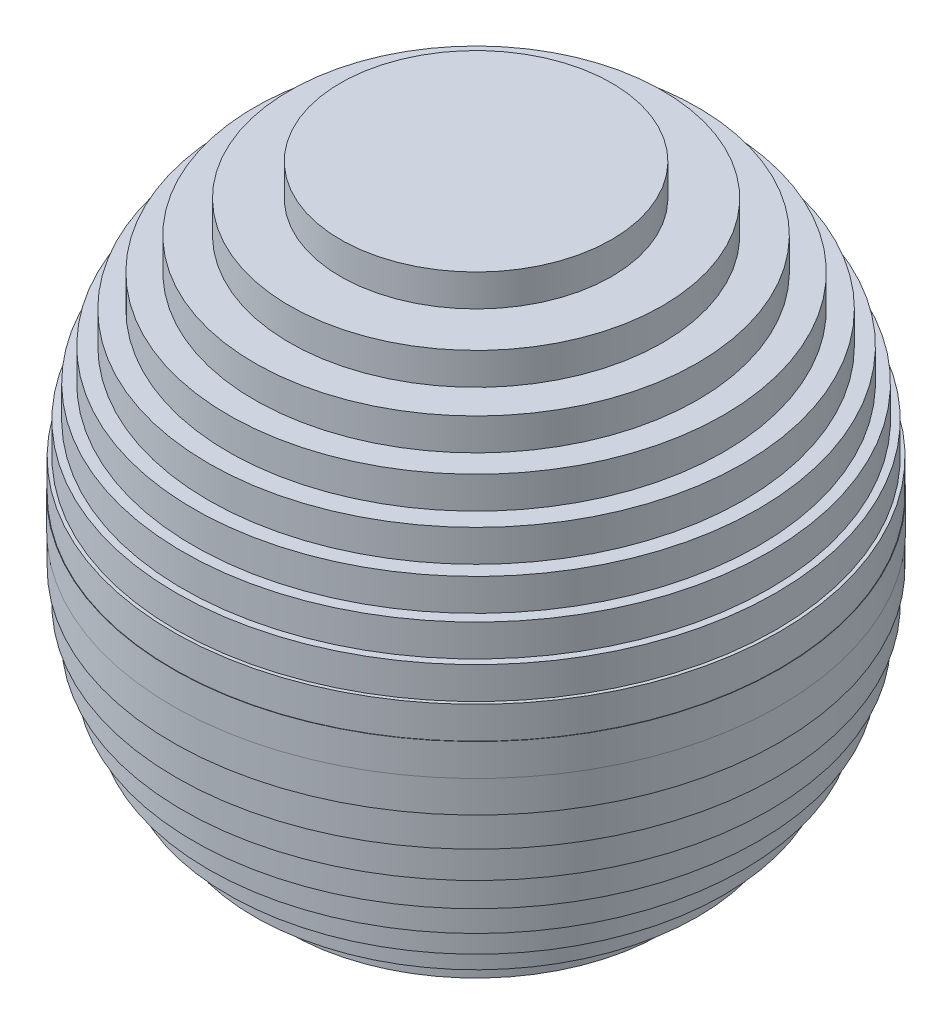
ISO-10303-21;
HEADER;
FILE_DESCRIPTION(('STEP AP214'),'2;1');
FILE_NAME('part.step','',(''),(''),'','','');
FILE_SCHEMA(('AUTOMOTIVE_DESIGN { 1 0 10303 214 1 1 1 1 }'));
ENDSEC;
DATA;
#1=APPLICATION_CONTEXT('core data for automotive mechanical design processes');
#2=APPLICATION_PROTOCOL_DEFINITION('international standard','automotive_design',2000,#1);
#3=PRODUCT_CONTEXT('',#1,'mechanical');
#4=PRODUCT('Part','Part','',(#3));
#5=PRODUCT_RELATED_PRODUCT_CATEGORY('part','',(#4));
#6=PRODUCT_DEFINITION_FORMATION('','',#4);
#7=PRODUCT_DEFINITION_CONTEXT('part definition',#1,'design');
#8=PRODUCT_DEFINITION('design','',#6,#7);
#9=PRODUCT_DEFINITION_SHAPE('','',#8);
#10=(LENGTH_UNIT() NAMED_UNIT(*) SI_UNIT(.MILLI.,.METRE.));
#11=(NAMED_UNIT(*) PLANE_ANGLE_UNIT() SI_UNIT($,.RADIAN.));
#12=(NAMED_UNIT(*) SI_UNIT($,.STERADIAN.) SOLID_ANGLE_UNIT());
#13=UNCERTAINTY_MEASURE_WITH_UNIT(LENGTH_MEASURE(1.E-05),#10,'distance_accuracy_value','');
#14=(GEOMETRIC_REPRESENTATION_CONTEXT(3) GLOBAL_UNCERTAINTY_ASSIGNED_CONTEXT((#13)) GLOBAL_UNIT_ASSIGNED_CONTEXT((#10,
#11,#12)) REPRESENTATION_CONTEXT('',''));
#15=CARTESIAN_POINT('',(0.,0.,0.));
#16=DIRECTION('',(0.,0.,1.));
#17=DIRECTION('',(1.,0.,0.));
#18=AXIS2_PLACEMENT_3D('',#15,#16,#17);
#19=CARTESIAN_POINT('',(47.4341649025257,2.49999999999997,0.));
#20=DIRECTION('',(0.,1.,0.));
#21=DIRECTION('',(-1.,0.,0.));
#22=AXIS2_PLACEMENT_3D('',#19,#20,#21);
#23=PLANE('',#22);
#24=CARTESIAN_POINT('',(0.,2.49999999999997,0.));
#25=DIRECTION('',(0.,-1.,0.));
#26=DIRECTION('',(1.,0.,0.));
#27=AXIS2_PLACEMENT_3D('',#24,#25,#26);
#28=CIRCLE('',#27,47.4341649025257);
#29=CARTESIAN_POINT('',(47.4341649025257,2.49999999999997,0.));
#30=VERTEX_POINT('',#29);
#31=EDGE_CURVE('E150',#30,#30,#28,.T.);
#32=ORIENTED_EDGE('',*,*,#31,.T.);
#33=EDGE_LOOP('',(#32));
#34=FACE_BOUND('',#33,.T.);
#35=CARTESIAN_POINT('',(0.,2.49999999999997,0.));
#36=DIRECTION('',(0.,-1.,0.));
#37=DIRECTION('',(1.,0.,0.));
#38=AXIS2_PLACEMENT_3D('',#35,#36,#37);
#39=CIRCLE('',#38,47.4999999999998);
#40=CARTESIAN_POINT('',(47.4999999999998,2.49999999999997,0.));
#41=VERTEX_POINT('',#40);
#42=EDGE_CURVE('E10',#41,#41,#39,.T.);
#43=ORIENTED_EDGE('',*,*,#42,.F.);
#44=EDGE_LOOP('',(#43));
#45=FACE_BOUND('',#44,.T.);
#46=ADVANCED_FACE('F32',(#34,#45),#23,.T.);
#47=CARTESIAN_POINT('',(0.,-47.5,0.));
#48=DIRECTION('',(0.,-1.,0.));
#49=DIRECTION('',(1.,0.,0.));
#50=AXIS2_PLACEMENT_3D('',#47,#48,#49);
#51=CYLINDRICAL_SURFACE('',#50,47.4999999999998);
#52=ORIENTED_EDGE('',*,*,#42,.T.);
#53=EDGE_LOOP('',(#52));
#54=FACE_BOUND('',#53,.T.);
#55=CARTESIAN_POINT('',(0.,-2.50000000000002,0.));
#56=DIRECTION('',(0.,-1.,0.));
#57=DIRECTION('',(1.,0.,0.));
#58=AXIS2_PLACEMENT_3D('',#55,#56,#57);
#59=CIRCLE('',#58,47.4999999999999);
#60=CARTESIAN_POINT('',(47.4999999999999,-2.50000000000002,0.));
#61=VERTEX_POINT('',#60);
#62=EDGE_CURVE('E38',#61,#61,#59,.T.);
#63=ORIENTED_EDGE('',*,*,#62,.F.);
#64=EDGE_LOOP('',(#63));
#65=FACE_BOUND('',#64,.T.);
#66=ADVANCED_FACE('F168',(#54,#65),#51,.T.);
#67=CARTESIAN_POINT('',(47.4999999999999,-2.50000000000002,0.));
#68=DIRECTION('',(0.,-1.,0.));
#69=DIRECTION('',(1.,0.,0.));
#70=AXIS2_PLACEMENT_3D('',#67,#68,#69);
#71=PLANE('',#70);
#72=ORIENTED_EDGE('',*,*,#62,.T.);
#73=EDGE_LOOP('',(#72));
#74=FACE_BOUND('',#73,.T.);
#75=CARTESIAN_POINT('',(0.,-2.50000000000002,0.));
#76=DIRECTION('',(0.,-1.,0.));
#77=DIRECTION('',(1.,0.,0.));
#78=AXIS2_PLACEMENT_3D('',#75,#76,#77);
#79=CIRCLE('',#78,47.4341649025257);
#80=CARTESIAN_POINT('',(47.4341649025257,-2.50000000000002,0.));
#81=VERTEX_POINT('',#80);
#82=EDGE_CURVE('E42',#81,#81,#79,.T.);
#83=ORIENTED_EDGE('',*,*,#82,.F.);
#84=EDGE_LOOP('',(#83));
#85=FACE_BOUND('',#84,.T.);
#86=ADVANCED_FACE('F172',(#74,#85),#71,.T.);
#87=CARTESIAN_POINT('',(0.,-47.5,0.));
#88=DIRECTION('',(0.,-1.,0.));
#89=DIRECTION('',(1.,0.,0.));
#90=AXIS2_PLACEMENT_3D('',#87,#88,#89);
#91=CYLINDRICAL_SURFACE('',#90,47.4341649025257);
#92=ORIENTED_EDGE('',*,*,#82,.T.);
#93=EDGE_LOOP('',(#92));
#94=FACE_BOUND('',#93,.T.);
#95=CARTESIAN_POINT('',(0.,-7.50000000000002,0.));
#96=DIRECTION('',(0.,-1.,0.));
#97=DIRECTION('',(1.,0.,0.));
#98=AXIS2_PLACEMENT_3D('',#95,#96,#97);
#99=CIRCLE('',#98,47.4341649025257);
#100=CARTESIAN_POINT('',(47.4341649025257,-7.50000000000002,0.));
#101=VERTEX_POINT('',#100);
#102=EDGE_CURVE('E46',#101,#101,#99,.T.);
#103=ORIENTED_EDGE('',*,*,#102,.F.);
#104=EDGE_LOOP('',(#103));
#105=FACE_BOUND('',#104,.T.);
#106=ADVANCED_FACE('F176',(#94,#105),#91,.T.);
#107=CARTESIAN_POINT('',(47.4341649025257,-7.50000000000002,0.));
#108=DIRECTION('',(0.,-1.,0.));
#109=DIRECTION('',(1.,0.,0.));
#110=AXIS2_PLACEMENT_3D('',#107,#108,#109);
#111=PLANE('',#110);
#112=ORIENTED_EDGE('',*,*,#102,.T.);
#113=EDGE_LOOP('',(#112));
#114=FACE_BOUND('',#113,.T.);
#115=CARTESIAN_POINT('',(0.,-7.50000000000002,0.));
#116=DIRECTION('',(0.,-1.,0.));
#117=DIRECTION('',(1.,0.,0.));
#118=AXIS2_PLACEMENT_3D('',#115,#116,#117);
#119=CIRCLE('',#118,46.9041575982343);
#120=CARTESIAN_POINT('',(46.9041575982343,-7.50000000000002,0.));
#121=VERTEX_POINT('',#120);
#122=EDGE_CURVE('E51',#121,#121,#119,.T.);
#123=ORIENTED_EDGE('',*,*,#122,.F.);
#124=EDGE_LOOP('',(#123));
#125=FACE_BOUND('',#124,.T.);
#126=ADVANCED_FACE('F182',(#114,#125),#111,.T.);
#127=CARTESIAN_POINT('',(0.,-47.5,0.));
#128=DIRECTION('',(0.,-1.,0.));
#129=DIRECTION('',(1.,0.,0.));
#130=AXIS2_PLACEMENT_3D('',#127,#128,#129);
#131=CYLINDRICAL_SURFACE('',#130,46.9041575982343);
#132=ORIENTED_EDGE('',*,*,#122,.T.);
#133=EDGE_LOOP('',(#132));
#134=FACE_BOUND('',#133,.T.);
#135=CARTESIAN_POINT('',(0.,-12.5,0.));
#136=DIRECTION('',(0.,-1.,0.));
#137=DIRECTION('',(1.,0.,0.));
#138=AXIS2_PLACEMENT_3D('',#135,#136,#137);
#139=CIRCLE('',#138,46.9041575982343);
#140=CARTESIAN_POINT('',(46.9041575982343,-12.5,0.));
#141=VERTEX_POINT('',#140);
#142=EDGE_CURVE('E54',#141,#141,#139,.T.);
#143=ORIENTED_EDGE('',*,*,#142,.F.);
#144=EDGE_LOOP('',(#143));
#145=FACE_BOUND('',#144,.T.);
#146=ADVANCED_FACE('F186',(#134,#145),#131,.T.);
#147=CARTESIAN_POINT('',(46.9041575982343,-12.5,0.));
#148=DIRECTION('',(0.,-1.,0.));
#149=DIRECTION('',(1.,0.,0.));
#150=AXIS2_PLACEMENT_3D('',#147,#148,#149);
#151=PLANE('',#150);
#152=ORIENTED_EDGE('',*,*,#142,.T.);
#153=EDGE_LOOP('',(#152));
#154=FACE_BOUND('',#153,.T.);
#155=CARTESIAN_POINT('',(0.,-12.5,0.));
#156=DIRECTION('',(0.,-1.,0.));
#157=DIRECTION('',(1.,0.,0.));
#158=AXIS2_PLACEMENT_3D('',#155,#156,#157);
#159=CIRCLE('',#158,45.8257569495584);
#160=CARTESIAN_POINT('',(45.8257569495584,-12.5,0.));
#161=VERTEX_POINT('',#160);
#162=EDGE_CURVE('E57',#161,#161,#159,.T.);
#163=ORIENTED_EDGE('',*,*,#162,.F.);
#164=EDGE_LOOP('',(#163));
#165=FACE_BOUND('',#164,.T.);
#166=ADVANCED_FACE('F190',(#154,#165),#151,.T.);
#167=CARTESIAN_POINT('',(0.,-47.5,0.));
#168=DIRECTION('',(0.,-1.,0.));
#169=DIRECTION('',(1.,0.,0.));
#170=AXIS2_PLACEMENT_3D('',#167,#168,#169);
#171=CYLINDRICAL_SURFACE('',#170,45.8257569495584);
#172=ORIENTED_EDGE('',*,*,#162,.T.);
#173=EDGE_LOOP('',(#172));
#174=FACE_BOUND('',#173,.T.);
#175=CARTESIAN_POINT('',(0.,-17.5,0.));
#176=DIRECTION('',(0.,-1.,0.));
#177=DIRECTION('',(1.,0.,0.));
#178=AXIS2_PLACEMENT_3D('',#175,#176,#177);
#179=CIRCLE('',#178,45.8257569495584);
#180=CARTESIAN_POINT('',(45.8257569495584,-17.5,0.));
#181=VERTEX_POINT('',#180);
#182=EDGE_CURVE('E60',#181,#181,#179,.T.);
#183=ORIENTED_EDGE('',*,*,#182,.F.);
#184=EDGE_LOOP('',(#183));
#185=FACE_BOUND('',#184,.T.);
#186=ADVANCED_FACE('F194',(#174,#185),#171,.T.);
#187=CARTESIAN_POINT('',(45.8257569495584,-17.5,0.));
#188=DIRECTION('',(0.,-1.,0.));
#189=DIRECTION('',(1.,0.,0.));
#190=AXIS2_PLACEMENT_3D('',#187,#188,#189);
#191=PLANE('',#190);
#192=ORIENTED_EDGE('',*,*,#182,.T.);
#193=EDGE_LOOP('',(#192));
#194=FACE_BOUND('',#193,.T.);
#195=CARTESIAN_POINT('',(0.,-17.5,0.));
#196=DIRECTION('',(0.,-1.,0.));
#197=DIRECTION('',(1.,0.,0.));
#198=AXIS2_PLACEMENT_3D('',#195,#196,#197);
#199=CIRCLE('',#198,44.1588043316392);
#200=CARTESIAN_POINT('',(44.1588043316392,-17.5,0.));
#201=VERTEX_POINT('',#200);
#202=EDGE_CURVE('E63',#201,#201,#199,.T.);
#203=ORIENTED_EDGE('',*,*,#202,.F.);
#204=EDGE_LOOP('',(#203));
#205=FACE_BOUND('',#204,.T.);
#206=ADVANCED_FACE('F198',(#194,#205),#191,.T.);
#207=CARTESIAN_POINT('',(0.,-47.5,0.));
#208=DIRECTION('',(0.,-1.,0.));
#209=DIRECTION('',(1.,0.,0.));
#210=AXIS2_PLACEMENT_3D('',#207,#208,#209);
#211=CYLINDRICAL_SURFACE('',#210,44.1588043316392);
#212=ORIENTED_EDGE('',*,*,#202,.T.);
#213=EDGE_LOOP('',(#212));
#214=FACE_BOUND('',#213,.T.);
#215=CARTESIAN_POINT('',(0.,-22.5,0.));
#216=DIRECTION('',(0.,-1.,0.));
#217=DIRECTION('',(1.,0.,0.));
#218=AXIS2_PLACEMENT_3D('',#215,#216,#217);
#219=CIRCLE('',#218,44.1588043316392);
#220=CARTESIAN_POINT('',(44.1588043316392,-22.5,0.));
#221=VERTEX_POINT('',#220);
#222=EDGE_CURVE('E66',#221,#221,#219,.T.);
#223=ORIENTED_EDGE('',*,*,#222,.F.);
#224=EDGE_LOOP('',(#223));
#225=FACE_BOUND('',#224,.T.);
#226=ADVANCED_FACE('F202',(#214,#225),#211,.T.);
#227=CARTESIAN_POINT('',(44.1588043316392,-22.5,0.));
#228=DIRECTION('',(0.,-1.,0.));
#229=DIRECTION('',(1.,0.,0.));
#230=AXIS2_PLACEMENT_3D('',#227,#228,#229);
#231=PLANE('',#230);
#232=ORIENTED_EDGE('',*,*,#222,.T.);
#233=EDGE_LOOP('',(#232));
#234=FACE_BOUND('',#233,.T.);
#235=CARTESIAN_POINT('',(0.,-22.5,0.));
#236=DIRECTION('',(0.,-1.,0.));
#237=DIRECTION('',(1.,0.,0.));
#238=AXIS2_PLACEMENT_3D('',#235,#236,#237);
#239=CIRCLE('',#238,41.8330013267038);
#240=CARTESIAN_POINT('',(41.8330013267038,-22.5,0.));
#241=VERTEX_POINT('',#240);
#242=EDGE_CURVE('E69',#241,#241,#239,.T.);
#243=ORIENTED_EDGE('',*,*,#242,.F.);
#244=EDGE_LOOP('',(#243));
#245=FACE_BOUND('',#244,.T.);
#246=ADVANCED_FACE('F206',(#234,#245),#231,.T.);
#247=CARTESIAN_POINT('',(0.,-47.5,0.));
#248=DIRECTION('',(0.,-1.,0.));
#249=DIRECTION('',(1.,0.,0.));
#250=AXIS2_PLACEMENT_3D('',#247,#248,#249);
#251=CYLINDRICAL_SURFACE('',#250,41.8330013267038);
#252=ORIENTED_EDGE('',*,*,#242,.T.);
#253=EDGE_LOOP('',(#252));
#254=FACE_BOUND('',#253,.T.);
#255=CARTESIAN_POINT('',(0.,-27.5,0.));
#256=DIRECTION('',(0.,-1.,0.));
#257=DIRECTION('',(1.,0.,0.));
#258=AXIS2_PLACEMENT_3D('',#255,#256,#257);
#259=CIRCLE('',#258,41.8330013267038);
#260=CARTESIAN_POINT('',(41.8330013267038,-27.5,0.));
#261=VERTEX_POINT('',#260);
#262=EDGE_CURVE('E72',#261,#261,#259,.T.);
#263=ORIENTED_EDGE('',*,*,#262,.F.);
#264=EDGE_LOOP('',(#263));
#265=FACE_BOUND('',#264,.T.);
#266=ADVANCED_FACE('F210',(#254,#265),#251,.T.);
#267=CARTESIAN_POINT('',(41.8330013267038,-27.5,0.));
#268=DIRECTION('',(0.,-1.,0.));
#269=DIRECTION('',(1.,0.,0.));
#270=AXIS2_PLACEMENT_3D('',#267,#268,#269);
#271=PLANE('',#270);
#272=ORIENTED_EDGE('',*,*,#262,.T.);
#273=EDGE_LOOP('',(#272));
#274=FACE_BOUND('',#273,.T.);
#275=CARTESIAN_POINT('',(0.,-27.5,0.));
#276=DIRECTION('',(0.,-1.,0.));
#277=DIRECTION('',(1.,0.,0.));
#278=AXIS2_PLACEMENT_3D('',#275,#276,#277);
#279=CIRCLE('',#278,38.7298334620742);
#280=CARTESIAN_POINT('',(38.7298334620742,-27.5,0.));
#281=VERTEX_POINT('',#280);
#282=EDGE_CURVE('E75',#281,#281,#279,.T.);
#283=ORIENTED_EDGE('',*,*,#282,.F.);
#284=EDGE_LOOP('',(#283));
#285=FACE_BOUND('',#284,.T.);
#286=ADVANCED_FACE('F214',(#274,#285),#271,.T.);
#287=CARTESIAN_POINT('',(0.,-47.5,0.));
#288=DIRECTION('',(0.,-1.,0.));
#289=DIRECTION('',(1.,0.,0.));
#290=AXIS2_PLACEMENT_3D('',#287,#288,#289);
#291=CYLINDRICAL_SURFACE('',#290,38.7298334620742);
#292=ORIENTED_EDGE('',*,*,#282,.T.);
#293=EDGE_LOOP('',(#292));
#294=FACE_BOUND('',#293,.T.);
#295=CARTESIAN_POINT('',(0.,-32.5,0.));
#296=DIRECTION('',(0.,-1.,0.));
#297=DIRECTION('',(1.,0.,0.));
#298=AXIS2_PLACEMENT_3D('',#295,#296,#297);
#299=CIRCLE('',#298,38.7298334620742);
#300=CARTESIAN_POINT('',(38.7298334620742,-32.5,0.));
#301=VERTEX_POINT('',#300);
#302=EDGE_CURVE('E78',#301,#301,#299,.T.);
#303=ORIENTED_EDGE('',*,*,#302,.F.);
#304=EDGE_LOOP('',(#303));
#305=FACE_BOUND('',#304,.T.);
#306=ADVANCED_FACE('F218',(#294,#305),#291,.T.);
#307=CARTESIAN_POINT('',(38.7298334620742,-32.5,0.));
#308=DIRECTION('',(0.,-1.,0.));
#309=DIRECTION('',(1.,0.,0.));
#310=AXIS2_PLACEMENT_3D('',#307,#308,#309);
#311=PLANE('',#310);
#312=ORIENTED_EDGE('',*,*,#302,.T.);
#313=EDGE_LOOP('',(#312));
#314=FACE_BOUND('',#313,.T.);
#315=CARTESIAN_POINT('',(0.,-32.5,0.));
#316=DIRECTION('',(0.,-1.,0.));
#317=DIRECTION('',(1.,0.,0.));
#318=AXIS2_PLACEMENT_3D('',#315,#316,#317);
#319=CIRCLE('',#318,34.6410161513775);
#320=CARTESIAN_POINT('',(34.6410161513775,-32.5,0.));
#321=VERTEX_POINT('',#320);
#322=EDGE_CURVE('E81',#321,#321,#319,.T.);
#323=ORIENTED_EDGE('',*,*,#322,.F.);
#324=EDGE_LOOP('',(#323));
#325=FACE_BOUND('',#324,.T.);
#326=ADVANCED_FACE('F222',(#314,#325),#311,.T.);
#327=CARTESIAN_POINT('',(0.,-47.5,0.));
#328=DIRECTION('',(0.,-1.,0.));
#329=DIRECTION('',(1.,0.,0.));
#330=AXIS2_PLACEMENT_3D('',#327,#328,#329);
#331=CYLINDRICAL_SURFACE('',#330,34.6410161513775);
#332=ORIENTED_EDGE('',*,*,#322,.T.);
#333=EDGE_LOOP('',(#332));
#334=FACE_BOUND('',#333,.T.);
#335=CARTESIAN_POINT('',(0.,-37.5,0.));
#336=DIRECTION('',(0.,-1.,0.));
#337=DIRECTION('',(1.,0.,0.));
#338=AXIS2_PLACEMENT_3D('',#335,#336,#337);
#339=CIRCLE('',#338,34.6410161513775);
#340=CARTESIAN_POINT('',(34.6410161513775,-37.5,0.));
#341=VERTEX_POINT('',#340);
#342=EDGE_CURVE('E84',#341,#341,#339,.T.);
#343=ORIENTED_EDGE('',*,*,#342,.F.);
#344=EDGE_LOOP('',(#343));
#345=FACE_BOUND('',#344,.T.);
#346=ADVANCED_FACE('F226',(#334,#345),#331,.T.);
#347=CARTESIAN_POINT('',(34.6410161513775,-37.5,0.));
#348=DIRECTION('',(0.,-1.,0.));
#349=DIRECTION('',(1.,0.,0.));
#350=AXIS2_PLACEMENT_3D('',#347,#348,#349);
#351=PLANE('',#350);
#352=ORIENTED_EDGE('',*,*,#342,.T.);
#353=EDGE_LOOP('',(#352));
#354=FACE_BOUND('',#353,.T.);
#355=CARTESIAN_POINT('',(0.,-37.5,0.));
#356=DIRECTION('',(0.,-1.,0.));
#357=DIRECTION('',(1.,0.,0.));
#358=AXIS2_PLACEMENT_3D('',#355,#356,#357);
#359=CIRCLE('',#358,29.1547594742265);
#360=CARTESIAN_POINT('',(29.1547594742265,-37.5,0.));
#361=VERTEX_POINT('',#360);
#362=EDGE_CURVE('E87',#361,#361,#359,.T.);
#363=ORIENTED_EDGE('',*,*,#362,.F.);
#364=EDGE_LOOP('',(#363));
#365=FACE_BOUND('',#364,.T.);
#366=ADVANCED_FACE('F230',(#354,#365),#351,.T.);
#367=CARTESIAN_POINT('',(0.,-47.5,0.));
#368=DIRECTION('',(0.,-1.,0.));
#369=DIRECTION('',(1.,0.,0.));
#370=AXIS2_PLACEMENT_3D('',#367,#368,#369);
#371=CYLINDRICAL_SURFACE('',#370,29.1547594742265);
#372=ORIENTED_EDGE('',*,*,#362,.T.);
#373=EDGE_LOOP('',(#372));
#374=FACE_BOUND('',#373,.T.);
#375=CARTESIAN_POINT('',(0.,-42.5,0.));
#376=DIRECTION('',(0.,-1.,0.));
#377=DIRECTION('',(1.,0.,0.));
#378=AXIS2_PLACEMENT_3D('',#375,#376,#377);
#379=CIRCLE('',#378,29.1547594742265);
#380=CARTESIAN_POINT('',(29.1547594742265,-42.5,0.));
#381=VERTEX_POINT('',#380);
#382=EDGE_CURVE('E90',#381,#381,#379,.T.);
#383=ORIENTED_EDGE('',*,*,#382,.F.);
#384=EDGE_LOOP('',(#383));
#385=FACE_BOUND('',#384,.T.);
#386=ADVANCED_FACE('F234',(#374,#385),#371,.T.);
#387=CARTESIAN_POINT('',(29.1547594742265,-42.5,0.));
#388=DIRECTION('',(0.,-1.,0.));
#389=DIRECTION('',(1.,0.,0.));
#390=AXIS2_PLACEMENT_3D('',#387,#388,#389);
#391=PLANE('',#390);
#392=ORIENTED_EDGE('',*,*,#382,.T.);
#393=EDGE_LOOP('',(#392));
#394=FACE_BOUND('',#393,.T.);
#395=CARTESIAN_POINT('',(0.,-42.5,0.));
#396=DIRECTION('',(0.,-1.,0.));
#397=DIRECTION('',(1.,0.,0.));
#398=AXIS2_PLACEMENT_3D('',#395,#396,#397);
#399=CIRCLE('',#398,21.2132034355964);
#400=CARTESIAN_POINT('',(21.2132034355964,-42.5,0.));
#401=VERTEX_POINT('',#400);
#402=EDGE_CURVE('E93',#401,#401,#399,.T.);
#403=ORIENTED_EDGE('',*,*,#402,.F.);
#404=EDGE_LOOP('',(#403));
#405=FACE_BOUND('',#404,.T.);
#406=ADVANCED_FACE('F238',(#394,#405),#391,.T.);
#407=CARTESIAN_POINT('',(0.,-47.5,0.));
#408=DIRECTION('',(0.,-1.,0.));
#409=DIRECTION('',(1.,0.,0.));
#410=AXIS2_PLACEMENT_3D('',#407,#408,#409);
#411=CYLINDRICAL_SURFACE('',#410,21.2132034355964);
#412=ORIENTED_EDGE('',*,*,#402,.T.);
#413=EDGE_LOOP('',(#412));
#414=FACE_BOUND('',#413,.T.);
#415=CARTESIAN_POINT('',(0.,-47.5,0.));
#416=DIRECTION('',(0.,-1.,0.));
#417=DIRECTION('',(1.,0.,0.));
#418=AXIS2_PLACEMENT_3D('',#415,#416,#417);
#419=CIRCLE('',#418,21.2132034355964);
#420=CARTESIAN_POINT('',(21.2132034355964,-47.5,0.));
#421=VERTEX_POINT('',#420);
#422=EDGE_CURVE('E96',#421,#421,#419,.T.);
#423=ORIENTED_EDGE('',*,*,#422,.F.);
#424=EDGE_LOOP('',(#423));
#425=FACE_BOUND('',#424,.T.);
#426=ADVANCED_FACE('F242',(#414,#425),#411,.T.);
#427=CARTESIAN_POINT('',(21.2132034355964,-47.5,0.));
#428=DIRECTION('',(0.,-1.,0.));
#429=DIRECTION('',(1.,0.,0.));
#430=AXIS2_PLACEMENT_3D('',#427,#428,#429);
#431=PLANE('',#430);
#432=ORIENTED_EDGE('',*,*,#422,.T.);
#433=EDGE_LOOP('',(#432));
#434=FACE_BOUND('',#433,.T.);
#435=ADVANCED_FACE('F246',(#434),#431,.T.);
#436=CARTESIAN_POINT('',(0.,47.5,0.));
#437=DIRECTION('',(0.,1.,0.));
#438=DIRECTION('',(-1.,0.,0.));
#439=AXIS2_PLACEMENT_3D('',#436,#437,#438);
#440=PLANE('',#439);
#441=CARTESIAN_POINT('',(0.,47.5,0.));
#442=DIRECTION('',(0.,-1.,0.));
#443=DIRECTION('',(1.,0.,0.));
#444=AXIS2_PLACEMENT_3D('',#441,#442,#443);
#445=CIRCLE('',#444,21.2132034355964);
#446=CARTESIAN_POINT('',(21.2132034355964,47.5,0.));
#447=VERTEX_POINT('',#446);
#448=EDGE_CURVE('E99',#447,#447,#445,.T.);
#449=ORIENTED_EDGE('',*,*,#448,.F.);
#450=EDGE_LOOP('',(#449));
#451=FACE_BOUND('',#450,.T.);
#452=ADVANCED_FACE('F250',(#451),#440,.T.);
#453=CARTESIAN_POINT('',(0.,-47.5,0.));
#454=DIRECTION('',(0.,-1.,0.));
#455=DIRECTION('',(1.,0.,0.));
#456=AXIS2_PLACEMENT_3D('',#453,#454,#455);
#457=CYLINDRICAL_SURFACE('',#456,21.2132034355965);
#458=ORIENTED_EDGE('',*,*,#448,.T.);
#459=EDGE_LOOP('',(#458));
#460=FACE_BOUND('',#459,.T.);
#461=CARTESIAN_POINT('',(0.,42.5,0.));
#462=DIRECTION('',(0.,-1.,0.));
#463=DIRECTION('',(1.,0.,0.));
#464=AXIS2_PLACEMENT_3D('',#461,#462,#463);
#465=CIRCLE('',#464,21.2132034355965);
#466=CARTESIAN_POINT('',(21.2132034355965,42.5,0.));
#467=VERTEX_POINT('',#466);
#468=EDGE_CURVE('E102',#467,#467,#465,.T.);
#469=ORIENTED_EDGE('',*,*,#468,.F.);
#470=EDGE_LOOP('',(#469));
#471=FACE_BOUND('',#470,.T.);
#472=ADVANCED_FACE('F254',(#460,#471),#457,.T.);
#473=CARTESIAN_POINT('',(21.2132034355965,42.5,0.));
#474=DIRECTION('',(0.,1.,0.));
#475=DIRECTION('',(-1.,0.,0.));
#476=AXIS2_PLACEMENT_3D('',#473,#474,#475);
#477=PLANE('',#476);
#478=ORIENTED_EDGE('',*,*,#468,.T.);
#479=EDGE_LOOP('',(#478));
#480=FACE_BOUND('',#479,.T.);
#481=CARTESIAN_POINT('',(0.,42.5,0.));
#482=DIRECTION('',(0.,-1.,0.));
#483=DIRECTION('',(1.,0.,0.));
#484=AXIS2_PLACEMENT_3D('',#481,#482,#483);
#485=CIRCLE('',#484,29.1547594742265);
#486=CARTESIAN_POINT('',(29.1547594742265,42.5,0.));
#487=VERTEX_POINT('',#486);
#488=EDGE_CURVE('E105',#487,#487,#485,.T.);
#489=ORIENTED_EDGE('',*,*,#488,.F.);
#490=EDGE_LOOP('',(#489));
#491=FACE_BOUND('',#490,.T.);
#492=ADVANCED_FACE('F258',(#480,#491),#477,.T.);
#493=CARTESIAN_POINT('',(0.,-47.5,0.));
#494=DIRECTION('',(0.,-1.,0.));
#495=DIRECTION('',(1.,0.,0.));
#496=AXIS2_PLACEMENT_3D('',#493,#494,#495);
#497=CYLINDRICAL_SURFACE('',#496,29.1547594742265);
#498=ORIENTED_EDGE('',*,*,#488,.T.);
#499=EDGE_LOOP('',(#498));
#500=FACE_BOUND('',#499,.T.);
#501=CARTESIAN_POINT('',(0.,37.5,0.));
#502=DIRECTION('',(0.,-1.,0.));
#503=DIRECTION('',(1.,0.,0.));
#504=AXIS2_PLACEMENT_3D('',#501,#502,#503);
#505=CIRCLE('',#504,29.1547594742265);
#506=CARTESIAN_POINT('',(29.1547594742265,37.5,0.));
#507=VERTEX_POINT('',#506);
#508=EDGE_CURVE('E108',#507,#507,#505,.T.);
#509=ORIENTED_EDGE('',*,*,#508,.F.);
#510=EDGE_LOOP('',(#509));
#511=FACE_BOUND('',#510,.T.);
#512=ADVANCED_FACE('F262',(#500,#511),#497,.T.);
#513=CARTESIAN_POINT('',(29.1547594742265,37.5,0.));
#514=DIRECTION('',(0.,1.,0.));
#515=DIRECTION('',(-1.,0.,0.));
#516=AXIS2_PLACEMENT_3D('',#513,#514,#515);
#517=PLANE('',#516);
#518=ORIENTED_EDGE('',*,*,#508,.T.);
#519=EDGE_LOOP('',(#518));
#520=FACE_BOUND('',#519,.T.);
#521=CARTESIAN_POINT('',(0.,37.5,0.));
#522=DIRECTION('',(0.,-1.,0.));
#523=DIRECTION('',(1.,0.,0.));
#524=AXIS2_PLACEMENT_3D('',#521,#522,#523);
#525=CIRCLE('',#524,34.6410161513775);
#526=CARTESIAN_POINT('',(34.6410161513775,37.5,0.));
#527=VERTEX_POINT('',#526);
#528=EDGE_CURVE('E111',#527,#527,#525,.T.);
#529=ORIENTED_EDGE('',*,*,#528,.F.);
#530=EDGE_LOOP('',(#529));
#531=FACE_BOUND('',#530,.T.);
#532=ADVANCED_FACE('F266',(#520,#531),#517,.T.);
#533=CARTESIAN_POINT('',(0.,-47.5,0.));
#534=DIRECTION('',(0.,-1.,0.));
#535=DIRECTION('',(1.,0.,0.));
#536=AXIS2_PLACEMENT_3D('',#533,#534,#535);
#537=CYLINDRICAL_SURFACE('',#536,34.6410161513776);
#538=ORIENTED_EDGE('',*,*,#528,.T.);
#539=EDGE_LOOP('',(#538));
#540=FACE_BOUND('',#539,.T.);
#541=CARTESIAN_POINT('',(0.,32.5,0.));
#542=DIRECTION('',(0.,-1.,0.));
#543=DIRECTION('',(1.,0.,0.));
#544=AXIS2_PLACEMENT_3D('',#541,#542,#543);
#545=CIRCLE('',#544,34.6410161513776);
#546=CARTESIAN_POINT('',(34.6410161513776,32.5,0.));
#547=VERTEX_POINT('',#546);
#548=EDGE_CURVE('E114',#547,#547,#545,.T.);
#549=ORIENTED_EDGE('',*,*,#548,.F.);
#550=EDGE_LOOP('',(#549));
#551=FACE_BOUND('',#550,.T.);
#552=ADVANCED_FACE('F270',(#540,#551),#537,.T.);
#553=CARTESIAN_POINT('',(34.6410161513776,32.5,0.));
#554=DIRECTION('',(0.,1.,0.));
#555=DIRECTION('',(-1.,0.,0.));
#556=AXIS2_PLACEMENT_3D('',#553,#554,#555);
#557=PLANE('',#556);
#558=ORIENTED_EDGE('',*,*,#548,.T.);
#559=EDGE_LOOP('',(#558));
#560=FACE_BOUND('',#559,.T.);
#561=CARTESIAN_POINT('',(0.,32.5,0.));
#562=DIRECTION('',(0.,-1.,0.));
#563=DIRECTION('',(1.,0.,0.));
#564=AXIS2_PLACEMENT_3D('',#561,#562,#563);
#565=CIRCLE('',#564,38.7298334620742);
#566=CARTESIAN_POINT('',(38.7298334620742,32.5,0.));
#567=VERTEX_POINT('',#566);
#568=EDGE_CURVE('E117',#567,#567,#565,.T.);
#569=ORIENTED_EDGE('',*,*,#568,.F.);
#570=EDGE_LOOP('',(#569));
#571=FACE_BOUND('',#570,.T.);
#572=ADVANCED_FACE('F274',(#560,#571),#557,.T.);
#573=CARTESIAN_POINT('',(0.,-47.5,0.));
#574=DIRECTION('',(0.,-1.,0.));
#575=DIRECTION('',(1.,0.,0.));
#576=AXIS2_PLACEMENT_3D('',#573,#574,#575);
#577=CYLINDRICAL_SURFACE('',#576,38.7298334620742);
#578=ORIENTED_EDGE('',*,*,#568,.T.);
#579=EDGE_LOOP('',(#578));
#580=FACE_BOUND('',#579,.T.);
#581=CARTESIAN_POINT('',(0.,27.5,0.));
#582=DIRECTION('',(0.,-1.,0.));
#583=DIRECTION('',(1.,0.,0.));
#584=AXIS2_PLACEMENT_3D('',#581,#582,#583);
#585=CIRCLE('',#584,38.7298334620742);
#586=CARTESIAN_POINT('',(38.7298334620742,27.5,0.));
#587=VERTEX_POINT('',#586);
#588=EDGE_CURVE('E120',#587,#587,#585,.T.);
#589=ORIENTED_EDGE('',*,*,#588,.F.);
#590=EDGE_LOOP('',(#589));
#591=FACE_BOUND('',#590,.T.);
#592=ADVANCED_FACE('F278',(#580,#591),#577,.T.);
#593=CARTESIAN_POINT('',(38.7298334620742,27.5,0.));
#594=DIRECTION('',(0.,1.,0.));
#595=DIRECTION('',(-1.,0.,0.));
#596=AXIS2_PLACEMENT_3D('',#593,#594,#595);
#597=PLANE('',#596);
#598=ORIENTED_EDGE('',*,*,#588,.T.);
#599=EDGE_LOOP('',(#598));
#600=FACE_BOUND('',#599,.T.);
#601=CARTESIAN_POINT('',(0.,27.5,0.));
#602=DIRECTION('',(0.,-1.,0.));
#603=DIRECTION('',(1.,0.,0.));
#604=AXIS2_PLACEMENT_3D('',#601,#602,#603);
#605=CIRCLE('',#604,41.8330013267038);
#606=CARTESIAN_POINT('',(41.8330013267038,27.5,0.));
#607=VERTEX_POINT('',#606);
#608=EDGE_CURVE('E123',#607,#607,#605,.T.);
#609=ORIENTED_EDGE('',*,*,#608,.F.);
#610=EDGE_LOOP('',(#609));
#611=FACE_BOUND('',#610,.T.);
#612=ADVANCED_FACE('F282',(#600,#611),#597,.T.);
#613=CARTESIAN_POINT('',(0.,-47.5,0.));
#614=DIRECTION('',(0.,-1.,0.));
#615=DIRECTION('',(1.,0.,0.));
#616=AXIS2_PLACEMENT_3D('',#613,#614,#615);
#617=CYLINDRICAL_SURFACE('',#616,41.8330013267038);
#618=ORIENTED_EDGE('',*,*,#608,.T.);
#619=EDGE_LOOP('',(#618));
#620=FACE_BOUND('',#619,.T.);
#621=CARTESIAN_POINT('',(0.,22.5,0.));
#622=DIRECTION('',(0.,-1.,0.));
#623=DIRECTION('',(1.,0.,0.));
#624=AXIS2_PLACEMENT_3D('',#621,#622,#623);
#625=CIRCLE('',#624,41.8330013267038);
#626=CARTESIAN_POINT('',(41.8330013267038,22.5,0.));
#627=VERTEX_POINT('',#626);
#628=EDGE_CURVE('E126',#627,#627,#625,.T.);
#629=ORIENTED_EDGE('',*,*,#628,.F.);
#630=EDGE_LOOP('',(#629));
#631=FACE_BOUND('',#630,.T.);
#632=ADVANCED_FACE('F286',(#620,#631),#617,.T.);
#633=CARTESIAN_POINT('',(41.8330013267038,22.5,0.));
#634=DIRECTION('',(0.,1.,0.));
#635=DIRECTION('',(-1.,0.,0.));
#636=AXIS2_PLACEMENT_3D('',#633,#634,#635);
#637=PLANE('',#636);
#638=ORIENTED_EDGE('',*,*,#628,.T.);
#639=EDGE_LOOP('',(#638));
#640=FACE_BOUND('',#639,.T.);
#641=CARTESIAN_POINT('',(0.,22.5,0.));
#642=DIRECTION('',(0.,-1.,0.));
#643=DIRECTION('',(1.,0.,0.));
#644=AXIS2_PLACEMENT_3D('',#641,#642,#643);
#645=CIRCLE('',#644,44.1588043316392);
#646=CARTESIAN_POINT('',(44.1588043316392,22.5,0.));
#647=VERTEX_POINT('',#646);
#648=EDGE_CURVE('E129',#647,#647,#645,.T.);
#649=ORIENTED_EDGE('',*,*,#648,.F.);
#650=EDGE_LOOP('',(#649));
#651=FACE_BOUND('',#650,.T.);
#652=ADVANCED_FACE('F290',(#640,#651),#637,.T.);
#653=CARTESIAN_POINT('',(0.,-47.5,0.));
#654=DIRECTION('',(0.,-1.,0.));
#655=DIRECTION('',(1.,0.,0.));
#656=AXIS2_PLACEMENT_3D('',#653,#654,#655);
#657=CYLINDRICAL_SURFACE('',#656,44.1588043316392);
#658=ORIENTED_EDGE('',*,*,#648,.T.);
#659=EDGE_LOOP('',(#658));
#660=FACE_BOUND('',#659,.T.);
#661=CARTESIAN_POINT('',(0.,17.5,0.));
#662=DIRECTION('',(0.,-1.,0.));
#663=DIRECTION('',(1.,0.,0.));
#664=AXIS2_PLACEMENT_3D('',#661,#662,#663);
#665=CIRCLE('',#664,44.1588043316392);
#666=CARTESIAN_POINT('',(44.1588043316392,17.5,0.));
#667=VERTEX_POINT('',#666);
#668=EDGE_CURVE('E132',#667,#667,#665,.T.);
#669=ORIENTED_EDGE('',*,*,#668,.F.);
#670=EDGE_LOOP('',(#669));
#671=FACE_BOUND('',#670,.T.);
#672=ADVANCED_FACE('F294',(#660,#671),#657,.T.);
#673=CARTESIAN_POINT('',(44.1588043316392,17.5,0.));
#674=DIRECTION('',(0.,1.,0.));
#675=DIRECTION('',(-1.,0.,0.));
#676=AXIS2_PLACEMENT_3D('',#673,#674,#675);
#677=PLANE('',#676);
#678=ORIENTED_EDGE('',*,*,#668,.T.);
#679=EDGE_LOOP('',(#678));
#680=FACE_BOUND('',#679,.T.);
#681=CARTESIAN_POINT('',(0.,17.5,0.));
#682=DIRECTION('',(0.,-1.,0.));
#683=DIRECTION('',(1.,0.,0.));
#684=AXIS2_PLACEMENT_3D('',#681,#682,#683);
#685=CIRCLE('',#684,45.8257569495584);
#686=CARTESIAN_POINT('',(45.8257569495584,17.5,0.));
#687=VERTEX_POINT('',#686);
#688=EDGE_CURVE('E135',#687,#687,#685,.T.);
#689=ORIENTED_EDGE('',*,*,#688,.F.);
#690=EDGE_LOOP('',(#689));
#691=FACE_BOUND('',#690,.T.);
#692=ADVANCED_FACE('F298',(#680,#691),#677,.T.);
#693=CARTESIAN_POINT('',(0.,-47.5,0.));
#694=DIRECTION('',(0.,-1.,0.));
#695=DIRECTION('',(1.,0.,0.));
#696=AXIS2_PLACEMENT_3D('',#693,#694,#695);
#697=CYLINDRICAL_SURFACE('',#696,45.8257569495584);
#698=ORIENTED_EDGE('',*,*,#688,.T.);
#699=EDGE_LOOP('',(#698));
#700=FACE_BOUND('',#699,.T.);
#701=CARTESIAN_POINT('',(0.,12.5,0.));
#702=DIRECTION('',(0.,-1.,0.));
#703=DIRECTION('',(1.,0.,0.));
#704=AXIS2_PLACEMENT_3D('',#701,#702,#703);
#705=CIRCLE('',#704,45.8257569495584);
#706=CARTESIAN_POINT('',(45.8257569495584,12.5,0.));
#707=VERTEX_POINT('',#706);
#708=EDGE_CURVE('E138',#707,#707,#705,.T.);
#709=ORIENTED_EDGE('',*,*,#708,.F.);
#710=EDGE_LOOP('',(#709));
#711=FACE_BOUND('',#710,.T.);
#712=ADVANCED_FACE('F302',(#700,#711),#697,.T.);
#713=CARTESIAN_POINT('',(45.8257569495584,12.5,0.));
#714=DIRECTION('',(0.,1.,0.));
#715=DIRECTION('',(-1.,0.,0.));
#716=AXIS2_PLACEMENT_3D('',#713,#714,#715);
#717=PLANE('',#716);
#718=ORIENTED_EDGE('',*,*,#708,.T.);
#719=EDGE_LOOP('',(#718));
#720=FACE_BOUND('',#719,.T.);
#721=CARTESIAN_POINT('',(0.,12.5,0.));
#722=DIRECTION('',(0.,-1.,0.));
#723=DIRECTION('',(1.,0.,0.));
#724=AXIS2_PLACEMENT_3D('',#721,#722,#723);
#725=CIRCLE('',#724,46.9041575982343);
#726=CARTESIAN_POINT('',(46.9041575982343,12.5,0.));
#727=VERTEX_POINT('',#726);
#728=EDGE_CURVE('E141',#727,#727,#725,.T.);
#729=ORIENTED_EDGE('',*,*,#728,.F.);
#730=EDGE_LOOP('',(#729));
#731=FACE_BOUND('',#730,.T.);
#732=ADVANCED_FACE('F306',(#720,#731),#717,.T.);
#733=CARTESIAN_POINT('',(0.,-47.5,0.));
#734=DIRECTION('',(0.,-1.,0.));
#735=DIRECTION('',(1.,0.,0.));
#736=AXIS2_PLACEMENT_3D('',#733,#734,#735);
#737=CYLINDRICAL_SURFACE('',#736,46.9041575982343);
#738=ORIENTED_EDGE('',*,*,#728,.T.);
#739=EDGE_LOOP('',(#738));
#740=FACE_BOUND('',#739,.T.);
#741=CARTESIAN_POINT('',(0.,7.49999999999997,0.));
#742=DIRECTION('',(0.,-1.,0.));
#743=DIRECTION('',(1.,0.,0.));
#744=AXIS2_PLACEMENT_3D('',#741,#742,#743);
#745=CIRCLE('',#744,46.9041575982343);
#746=CARTESIAN_POINT('',(46.9041575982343,7.49999999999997,0.));
#747=VERTEX_POINT('',#746);
#748=EDGE_CURVE('E144',#747,#747,#745,.T.);
#749=ORIENTED_EDGE('',*,*,#748,.F.);
#750=EDGE_LOOP('',(#749));
#751=FACE_BOUND('',#750,.T.);
#752=ADVANCED_FACE('F164',(#740,#751),#737,.T.);
#753=CARTESIAN_POINT('',(46.9041575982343,7.49999999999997,0.));
#754=DIRECTION('',(0.,1.,0.));
#755=DIRECTION('',(-1.,0.,0.));
#756=AXIS2_PLACEMENT_3D('',#753,#754,#755);
#757=PLANE('',#756);
#758=ORIENTED_EDGE('',*,*,#748,.T.);
#759=EDGE_LOOP('',(#758));
#760=FACE_BOUND('',#759,.T.);
#761=CARTESIAN_POINT('',(0.,7.49999999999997,0.));
#762=DIRECTION('',(0.,-1.,0.));
#763=DIRECTION('',(1.,0.,0.));
#764=AXIS2_PLACEMENT_3D('',#761,#762,#763);
#765=CIRCLE('',#764,47.4341649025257);
#766=CARTESIAN_POINT('',(47.4341649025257,7.49999999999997,0.));
#767=VERTEX_POINT('',#766);
#768=EDGE_CURVE('E147',#767,#767,#765,.T.);
#769=ORIENTED_EDGE('',*,*,#768,.F.);
#770=EDGE_LOOP('',(#769));
#771=FACE_BOUND('',#770,.T.);
#772=ADVANCED_FACE('F158',(#760,#771),#757,.T.);
#773=CARTESIAN_POINT('',(0.,-47.5,0.));
#774=DIRECTION('',(0.,-1.,0.));
#775=DIRECTION('',(1.,0.,0.));
#776=AXIS2_PLACEMENT_3D('',#773,#774,#775);
#777=CYLINDRICAL_SURFACE('',#776,47.4341649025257);
#778=ORIENTED_EDGE('',*,*,#768,.T.);
#779=EDGE_LOOP('',(#778));
#780=FACE_BOUND('',#779,.T.);
#781=ORIENTED_EDGE('',*,*,#31,.F.);
#782=EDGE_LOOP('',(#781));
#783=FACE_BOUND('',#782,.T.);
#784=ADVANCED_FACE('F156',(#780,#783),#777,.T.);
#785=CLOSED_SHELL('',(#46,#66,#86,#106,#126,#146,#166,#186,#206,#226,#246,#266,#286,#306,#326,
#346,#366,#386,#406,#426,#435,#452,#472,#492,#512,#532,#552,#572,#592,#612,#632,#652,#672,#692,
#712,#732,#752,#772,#784));
#786=MANIFOLD_SOLID_BREP('B2',#785);
#787=ADVANCED_BREP_SHAPE_REPRESENTATION('',(#18,#786),#14);
#788=SHAPE_DEFINITION_REPRESENTATION(#9,#787);
ENDSEC;
END-ISO-10303-21;
